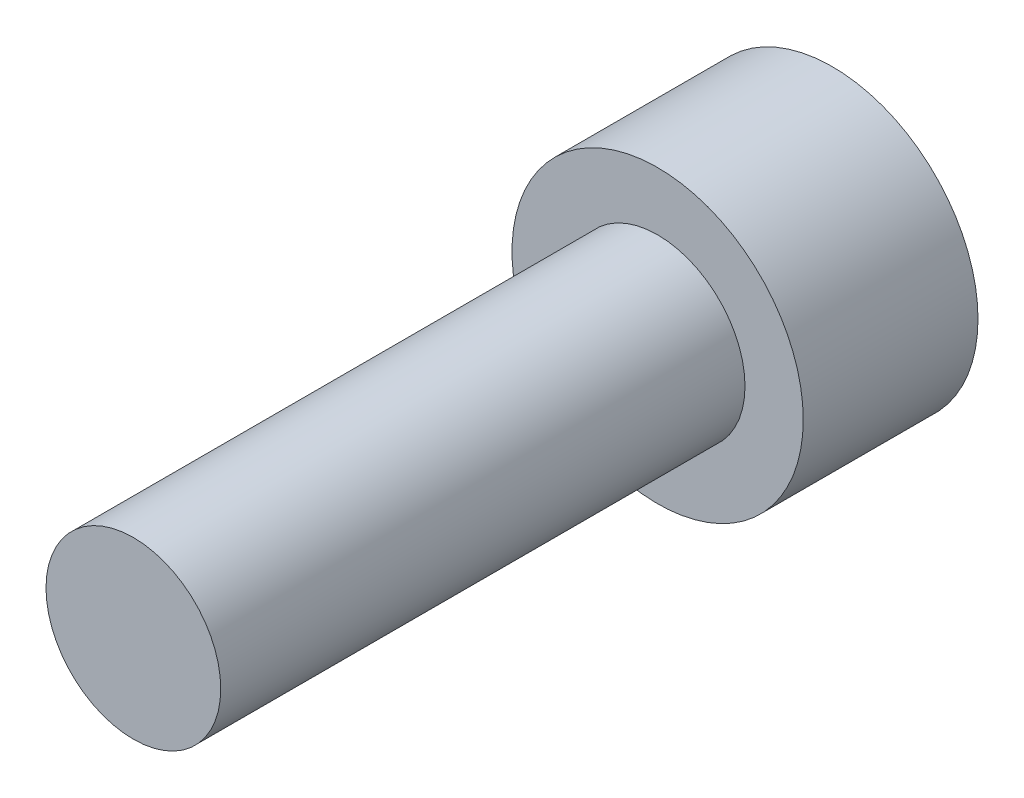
ISO-10303-21;
HEADER;
FILE_DESCRIPTION(('STEP AP214'),'2;1');
FILE_NAME('part.step','',(''),(''),'','','');
FILE_SCHEMA(('AUTOMOTIVE_DESIGN { 1 0 10303 214 1 1 1 1 }'));
ENDSEC;
DATA;
#1=APPLICATION_CONTEXT('core data for automotive mechanical design processes');
#2=APPLICATION_PROTOCOL_DEFINITION('international standard','automotive_design',2000,#1);
#3=PRODUCT_CONTEXT('',#1,'mechanical');
#4=PRODUCT('Part','Part','',(#3));
#5=PRODUCT_RELATED_PRODUCT_CATEGORY('part','',(#4));
#6=PRODUCT_DEFINITION_FORMATION('','',#4);
#7=PRODUCT_DEFINITION_CONTEXT('part definition',#1,'design');
#8=PRODUCT_DEFINITION('design','',#6,#7);
#9=PRODUCT_DEFINITION_SHAPE('','',#8);
#10=(LENGTH_UNIT() NAMED_UNIT(*) SI_UNIT(.MILLI.,.METRE.));
#11=(NAMED_UNIT(*) PLANE_ANGLE_UNIT() SI_UNIT($,.RADIAN.));
#12=(NAMED_UNIT(*) SI_UNIT($,.STERADIAN.) SOLID_ANGLE_UNIT());
#13=UNCERTAINTY_MEASURE_WITH_UNIT(LENGTH_MEASURE(1.E-05),#10,'distance_accuracy_value','');
#14=(GEOMETRIC_REPRESENTATION_CONTEXT(3) GLOBAL_UNCERTAINTY_ASSIGNED_CONTEXT((#13)) GLOBAL_UNIT_ASSIGNED_CONTEXT((#10,
#11,#12)) REPRESENTATION_CONTEXT('',''));
#15=CARTESIAN_POINT('',(0.,0.,0.));
#16=DIRECTION('',(0.,0.,1.));
#17=DIRECTION('',(1.,0.,0.));
#18=AXIS2_PLACEMENT_3D('',#15,#16,#17);
#19=CARTESIAN_POINT('',(0.,0.,18.));
#20=DIRECTION('',(0.,0.,1.));
#21=DIRECTION('',(1.,0.,0.));
#22=AXIS2_PLACEMENT_3D('',#19,#20,#21);
#23=PLANE('',#22);
#24=CARTESIAN_POINT('',(0.,0.,18.));
#25=DIRECTION('',(0.,0.,1.));
#26=DIRECTION('',(1.,0.,0.));
#27=AXIS2_PLACEMENT_3D('',#24,#25,#26);
#28=CIRCLE('',#27,3.);
#29=CARTESIAN_POINT('',(3.,0.,18.));
#30=VERTEX_POINT('',#29);
#31=EDGE_CURVE('E11',#30,#30,#28,.T.);
#32=ORIENTED_EDGE('',*,*,#31,.T.);
#33=EDGE_LOOP('',(#32));
#34=FACE_BOUND('',#33,.T.);
#35=ADVANCED_FACE('F32',(#34),#23,.T.);
#36=CARTESIAN_POINT('',(0.,0.,18.));
#37=DIRECTION('',(0.,0.,1.));
#38=DIRECTION('',(1.,0.,0.));
#39=AXIS2_PLACEMENT_3D('',#36,#37,#38);
#40=CYLINDRICAL_SURFACE('',#39,3.);
#41=CARTESIAN_POINT('',(0.,0.,0.));
#42=DIRECTION('',(0.,0.,1.));
#43=DIRECTION('',(1.,0.,0.));
#44=AXIS2_PLACEMENT_3D('',#41,#42,#43);
#45=CIRCLE('',#44,3.);
#46=CARTESIAN_POINT('',(3.,0.,0.));
#47=VERTEX_POINT('',#46);
#48=EDGE_CURVE('E39',#47,#47,#45,.T.);
#49=ORIENTED_EDGE('',*,*,#48,.T.);
#50=EDGE_LOOP('',(#49));
#51=FACE_BOUND('',#50,.T.);
#52=ORIENTED_EDGE('',*,*,#31,.F.);
#53=EDGE_LOOP('',(#52));
#54=FACE_BOUND('',#53,.T.);
#55=ADVANCED_FACE('F146',(#51,#54),#40,.T.);
#56=CARTESIAN_POINT('',(0.,-3.,0.));
#57=DIRECTION('',(0.,0.,1.));
#58=DIRECTION('',(1.,0.,0.));
#59=AXIS2_PLACEMENT_3D('',#56,#57,#58);
#60=PLANE('',#59);
#61=CARTESIAN_POINT('',(0.,0.,0.));
#62=DIRECTION('',(0.,0.,1.));
#63=DIRECTION('',(1.,0.,0.));
#64=AXIS2_PLACEMENT_3D('',#61,#62,#63);
#65=CIRCLE('',#64,5.);
#66=CARTESIAN_POINT('',(5.,0.,0.));
#67=VERTEX_POINT('',#66);
#68=EDGE_CURVE('E141',#67,#67,#65,.T.);
#69=ORIENTED_EDGE('',*,*,#68,.T.);
#70=EDGE_LOOP('',(#69));
#71=FACE_BOUND('',#70,.T.);
#72=ORIENTED_EDGE('',*,*,#48,.F.);
#73=EDGE_LOOP('',(#72));
#74=FACE_BOUND('',#73,.T.);
#75=ADVANCED_FACE('F149',(#71,#74),#60,.T.);
#76=CARTESIAN_POINT('',(0.,0.,18.));
#77=DIRECTION('',(0.,0.,1.));
#78=DIRECTION('',(1.,0.,0.));
#79=AXIS2_PLACEMENT_3D('',#76,#77,#78);
#80=CYLINDRICAL_SURFACE('',#79,5.);
#81=CARTESIAN_POINT('',(0.,0.,-6.));
#82=DIRECTION('',(0.,0.,1.));
#83=DIRECTION('',(1.,0.,0.));
#84=AXIS2_PLACEMENT_3D('',#81,#82,#83);
#85=CIRCLE('',#84,5.);
#86=CARTESIAN_POINT('',(5.,0.,-6.));
#87=VERTEX_POINT('',#86);
#88=EDGE_CURVE('E133',#87,#87,#85,.T.);
#89=ORIENTED_EDGE('',*,*,#88,.T.);
#90=EDGE_LOOP('',(#89));
#91=FACE_BOUND('',#90,.T.);
#92=ORIENTED_EDGE('',*,*,#68,.F.);
#93=EDGE_LOOP('',(#92));
#94=FACE_BOUND('',#93,.T.);
#95=ADVANCED_FACE('F151',(#91,#94),#80,.T.);
#96=CARTESIAN_POINT('',(0.,-5.,-6.));
#97=DIRECTION('',(0.,0.,-1.));
#98=DIRECTION('',(-1.,0.,0.));
#99=AXIS2_PLACEMENT_3D('',#96,#97,#98);
#100=PLANE('',#99);
#101=DIRECTION('',(0.866025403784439,-0.5,0.));
#102=VECTOR('',#101,1.);
#103=CARTESIAN_POINT('',(0.,2.88675134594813,-6.));
#104=LINE('',#103,#102);
#105=CARTESIAN_POINT('',(0.,2.88675134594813,-6.));
#106=VERTEX_POINT('',#105);
#107=CARTESIAN_POINT('',(2.5,1.44337567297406,-6.));
#108=VERTEX_POINT('',#107);
#109=EDGE_CURVE('E46',#106,#108,#104,.T.);
#110=ORIENTED_EDGE('',*,*,#109,.F.);
#111=DIRECTION('',(0.866025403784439,0.5,0.));
#112=VECTOR('',#111,1.);
#113=CARTESIAN_POINT('',(-2.5,1.44337567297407,-6.));
#114=LINE('',#113,#112);
#115=CARTESIAN_POINT('',(-2.5,1.44337567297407,-6.));
#116=VERTEX_POINT('',#115);
#117=EDGE_CURVE('E129',#116,#106,#114,.T.);
#118=ORIENTED_EDGE('',*,*,#117,.F.);
#119=DIRECTION('',(0.,1.,0.));
#120=VECTOR('',#119,1.);
#121=CARTESIAN_POINT('',(-2.5,-1.44337567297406,-6.));
#122=LINE('',#121,#120);
#123=CARTESIAN_POINT('',(-2.5,-1.44337567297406,-6.));
#124=VERTEX_POINT('',#123);
#125=EDGE_CURVE('E127',#124,#116,#122,.T.);
#126=ORIENTED_EDGE('',*,*,#125,.F.);
#127=DIRECTION('',(-0.866025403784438,0.5,0.));
#128=VECTOR('',#127,1.);
#129=CARTESIAN_POINT('',(0.,-2.88675134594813,-6.));
#130=LINE('',#129,#128);
#131=CARTESIAN_POINT('',(0.,-2.88675134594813,-6.));
#132=VERTEX_POINT('',#131);
#133=EDGE_CURVE('E94',#132,#124,#130,.T.);
#134=ORIENTED_EDGE('',*,*,#133,.F.);
#135=DIRECTION('',(-0.866025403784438,-0.5,0.));
#136=VECTOR('',#135,1.);
#137=CARTESIAN_POINT('',(2.5,-1.44337567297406,-6.));
#138=LINE('',#137,#136);
#139=CARTESIAN_POINT('',(2.5,-1.44337567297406,-6.));
#140=VERTEX_POINT('',#139);
#141=EDGE_CURVE('E123',#140,#132,#138,.T.);
#142=ORIENTED_EDGE('',*,*,#141,.F.);
#143=DIRECTION('',(0.,-1.,0.));
#144=VECTOR('',#143,1.);
#145=CARTESIAN_POINT('',(2.5,1.44337567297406,-6.));
#146=LINE('',#145,#144);
#147=EDGE_CURVE('E120',#108,#140,#146,.T.);
#148=ORIENTED_EDGE('',*,*,#147,.F.);
#149=EDGE_LOOP('',(#110,#118,#126,#134,#142,#148));
#150=FACE_BOUND('',#149,.T.);
#151=ORIENTED_EDGE('',*,*,#88,.F.);
#152=EDGE_LOOP('',(#151));
#153=FACE_BOUND('',#152,.T.);
#154=ADVANCED_FACE('F158',(#150,#153),#100,.T.);
#155=CARTESIAN_POINT('',(0.,2.88675134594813,-1.));
#156=DIRECTION('',(0.5,0.866025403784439,0.));
#157=DIRECTION('',(-0.866025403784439,0.5,0.));
#158=AXIS2_PLACEMENT_3D('',#155,#156,#157);
#159=PLANE('',#158);
#160=ORIENTED_EDGE('',*,*,#109,.T.);
#161=DIRECTION('',(0.,0.,-1.));
#162=VECTOR('',#161,1.);
#163=CARTESIAN_POINT('',(2.5,1.44337567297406,-1.));
#164=LINE('',#163,#162);
#165=CARTESIAN_POINT('',(2.5,1.44337567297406,-1.));
#166=VERTEX_POINT('',#165);
#167=EDGE_CURVE('E76',#166,#108,#164,.T.);
#168=ORIENTED_EDGE('',*,*,#167,.F.);
#169=DIRECTION('',(0.866025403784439,-0.5,0.));
#170=VECTOR('',#169,1.);
#171=CARTESIAN_POINT('',(0.,2.88675134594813,-1.));
#172=LINE('',#171,#170);
#173=CARTESIAN_POINT('',(0.,2.88675134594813,-1.));
#174=VERTEX_POINT('',#173);
#175=EDGE_CURVE('E131',#174,#166,#172,.T.);
#176=ORIENTED_EDGE('',*,*,#175,.F.);
#177=DIRECTION('',(0.,0.,-1.));
#178=VECTOR('',#177,1.);
#179=CARTESIAN_POINT('',(0.,2.88675134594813,-1.));
#180=LINE('',#179,#178);
#181=EDGE_CURVE('E54',#174,#106,#180,.T.);
#182=ORIENTED_EDGE('',*,*,#181,.T.);
#183=EDGE_LOOP('',(#160,#168,#176,#182));
#184=FACE_BOUND('',#183,.T.);
#185=ADVANCED_FACE('F189',(#184),#159,.F.);
#186=CARTESIAN_POINT('',(-2.5,1.44337567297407,-1.));
#187=DIRECTION('',(-0.5,0.866025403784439,0.));
#188=DIRECTION('',(-0.866025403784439,-0.5,0.));
#189=AXIS2_PLACEMENT_3D('',#186,#187,#188);
#190=PLANE('',#189);
#191=ORIENTED_EDGE('',*,*,#117,.T.);
#192=ORIENTED_EDGE('',*,*,#181,.F.);
#193=DIRECTION('',(0.866025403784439,0.5,0.));
#194=VECTOR('',#193,1.);
#195=CARTESIAN_POINT('',(-2.5,1.44337567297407,-1.));
#196=LINE('',#195,#194);
#197=CARTESIAN_POINT('',(-2.5,1.44337567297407,-1.));
#198=VERTEX_POINT('',#197);
#199=EDGE_CURVE('E106',#198,#174,#196,.T.);
#200=ORIENTED_EDGE('',*,*,#199,.F.);
#201=DIRECTION('',(0.,0.,-1.));
#202=VECTOR('',#201,1.);
#203=CARTESIAN_POINT('',(-2.5,1.44337567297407,-1.));
#204=LINE('',#203,#202);
#205=EDGE_CURVE('E98',#198,#116,#204,.T.);
#206=ORIENTED_EDGE('',*,*,#205,.T.);
#207=EDGE_LOOP('',(#191,#192,#200,#206));
#208=FACE_BOUND('',#207,.T.);
#209=ADVANCED_FACE('F199',(#208),#190,.F.);
#210=CARTESIAN_POINT('',(-2.5,-1.44337567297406,-1.));
#211=DIRECTION('',(-1.,0.,0.));
#212=DIRECTION('',(0.,-1.,0.));
#213=AXIS2_PLACEMENT_3D('',#210,#211,#212);
#214=PLANE('',#213);
#215=ORIENTED_EDGE('',*,*,#125,.T.);
#216=ORIENTED_EDGE('',*,*,#205,.F.);
#217=DIRECTION('',(0.,1.,0.));
#218=VECTOR('',#217,1.);
#219=CARTESIAN_POINT('',(-2.5,-1.44337567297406,-1.));
#220=LINE('',#219,#218);
#221=CARTESIAN_POINT('',(-2.5,-1.44337567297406,-1.));
#222=VERTEX_POINT('',#221);
#223=EDGE_CURVE('E102',#222,#198,#220,.T.);
#224=ORIENTED_EDGE('',*,*,#223,.F.);
#225=DIRECTION('',(0.,0.,-1.));
#226=VECTOR('',#225,1.);
#227=CARTESIAN_POINT('',(-2.5,-1.44337567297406,-1.));
#228=LINE('',#227,#226);
#229=EDGE_CURVE('E87',#222,#124,#228,.T.);
#230=ORIENTED_EDGE('',*,*,#229,.T.);
#231=EDGE_LOOP('',(#215,#216,#224,#230));
#232=FACE_BOUND('',#231,.T.);
#233=ADVANCED_FACE('F103',(#232),#214,.F.);
#234=CARTESIAN_POINT('',(0.,-2.88675134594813,-1.));
#235=DIRECTION('',(-0.5,-0.866025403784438,0.));
#236=DIRECTION('',(0.866025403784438,-0.5,0.));
#237=AXIS2_PLACEMENT_3D('',#234,#235,#236);
#238=PLANE('',#237);
#239=ORIENTED_EDGE('',*,*,#133,.T.);
#240=ORIENTED_EDGE('',*,*,#229,.F.);
#241=DIRECTION('',(-0.866025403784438,0.5,0.));
#242=VECTOR('',#241,1.);
#243=CARTESIAN_POINT('',(0.,-2.88675134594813,-1.));
#244=LINE('',#243,#242);
#245=CARTESIAN_POINT('',(0.,-2.88675134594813,-1.));
#246=VERTEX_POINT('',#245);
#247=EDGE_CURVE('E91',#246,#222,#244,.T.);
#248=ORIENTED_EDGE('',*,*,#247,.F.);
#249=DIRECTION('',(0.,0.,-1.));
#250=VECTOR('',#249,1.);
#251=CARTESIAN_POINT('',(0.,-2.88675134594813,-1.));
#252=LINE('',#251,#250);
#253=EDGE_CURVE('E99',#246,#132,#252,.T.);
#254=ORIENTED_EDGE('',*,*,#253,.T.);
#255=EDGE_LOOP('',(#239,#240,#248,#254));
#256=FACE_BOUND('',#255,.T.);
#257=ADVANCED_FACE('F89',(#256),#238,.F.);
#258=CARTESIAN_POINT('',(2.5,-1.44337567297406,-1.));
#259=DIRECTION('',(0.5,-0.866025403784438,0.));
#260=DIRECTION('',(0.866025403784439,0.5,0.));
#261=AXIS2_PLACEMENT_3D('',#258,#259,#260);
#262=PLANE('',#261);
#263=ORIENTED_EDGE('',*,*,#141,.T.);
#264=ORIENTED_EDGE('',*,*,#253,.F.);
#265=DIRECTION('',(-0.866025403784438,-0.5,0.));
#266=VECTOR('',#265,1.);
#267=CARTESIAN_POINT('',(2.5,-1.44337567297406,-1.));
#268=LINE('',#267,#266);
#269=CARTESIAN_POINT('',(2.5,-1.44337567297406,-1.));
#270=VERTEX_POINT('',#269);
#271=EDGE_CURVE('E112',#270,#246,#268,.T.);
#272=ORIENTED_EDGE('',*,*,#271,.F.);
#273=DIRECTION('',(0.,0.,-1.));
#274=VECTOR('',#273,1.);
#275=CARTESIAN_POINT('',(2.5,-1.44337567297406,-1.));
#276=LINE('',#275,#274);
#277=EDGE_CURVE('E136',#270,#140,#276,.T.);
#278=ORIENTED_EDGE('',*,*,#277,.T.);
#279=EDGE_LOOP('',(#263,#264,#272,#278));
#280=FACE_BOUND('',#279,.T.);
#281=ADVANCED_FACE('F224',(#280),#262,.F.);
#282=CARTESIAN_POINT('',(2.5,1.44337567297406,-1.));
#283=DIRECTION('',(1.,0.,0.));
#284=DIRECTION('',(0.,0.,-1.));
#285=AXIS2_PLACEMENT_3D('',#282,#283,#284);
#286=PLANE('',#285);
#287=ORIENTED_EDGE('',*,*,#147,.T.);
#288=ORIENTED_EDGE('',*,*,#277,.F.);
#289=DIRECTION('',(0.,-1.,0.));
#290=VECTOR('',#289,1.);
#291=CARTESIAN_POINT('',(2.5,1.44337567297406,-1.));
#292=LINE('',#291,#290);
#293=EDGE_CURVE('E114',#166,#270,#292,.T.);
#294=ORIENTED_EDGE('',*,*,#293,.F.);
#295=ORIENTED_EDGE('',*,*,#167,.T.);
#296=EDGE_LOOP('',(#287,#288,#294,#295));
#297=FACE_BOUND('',#296,.T.);
#298=ADVANCED_FACE('F233',(#297),#286,.F.);
#299=CARTESIAN_POINT('',(5.,0.,-1.));
#300=DIRECTION('',(0.,0.,-1.));
#301=DIRECTION('',(-1.,0.,0.));
#302=AXIS2_PLACEMENT_3D('',#299,#300,#301);
#303=PLANE('',#302);
#304=ORIENTED_EDGE('',*,*,#175,.T.);
#305=ORIENTED_EDGE('',*,*,#293,.T.);
#306=ORIENTED_EDGE('',*,*,#271,.T.);
#307=ORIENTED_EDGE('',*,*,#247,.T.);
#308=ORIENTED_EDGE('',*,*,#223,.T.);
#309=ORIENTED_EDGE('',*,*,#199,.T.);
#310=EDGE_LOOP('',(#304,#305,#306,#307,#308,#309));
#311=FACE_BOUND('',#310,.T.);
#312=ADVANCED_FACE('F109',(#311),#303,.T.);
#313=CLOSED_SHELL('',(#35,#55,#75,#95,#154,#185,#209,#233,#257,#281,#298,#312));
#314=MANIFOLD_SOLID_BREP('B2',#313);
#315=ADVANCED_BREP_SHAPE_REPRESENTATION('',(#18,#314),#14);
#316=SHAPE_DEFINITION_REPRESENTATION(#9,#315);
ENDSEC;
END-ISO-10303-21;
